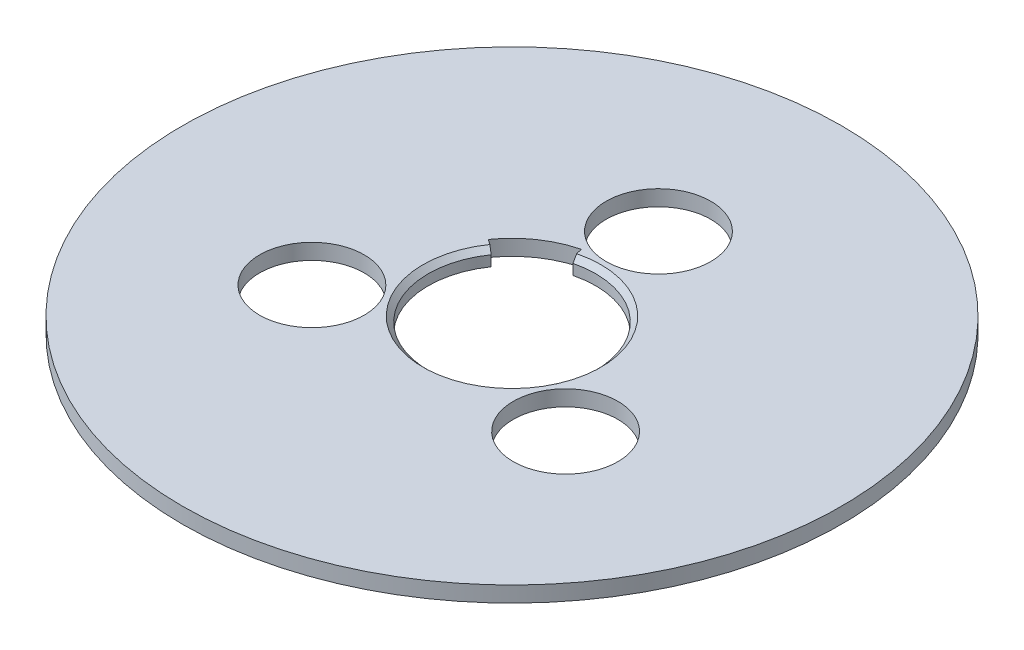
from build123d import *

# Parameters (mm, degrees)
SKETCH1_R           = 31.5
BOSS_EXTRUDE1_DEPTH = 1.5
CHAMFER1_SIZE       = 0.5
SKETCH2_R           = 5
CUT_EXTRUDE1_DEPTH  = 45.572973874


with BuildPart() as part:
    # Sketch1 → Boss-Extrude1 (new body)
    with BuildSketch(Plane(origin=(0, 0, 0), x_dir=(1, 0, 0), z_dir=(0, 1, 0))):
        with Locations(Location((0, 0, 0), (0, 0, 270))):
            Circle(SKETCH1_R)
        with BuildLine():
            Line((-1.938841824, 7.761500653), (-2.070683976, 8.289286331))
            Line((-2.070683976, 8.289286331), (-2.205432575, 8.828706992))
            ThreePointArc((-2.205432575, 8.828706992), (-5.164976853, 7.492196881), (-7.466804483, 5.201618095))
            Line((-7.466804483, 5.201618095), (-7.010594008, 4.883807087))
            Line((-7.010594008, 4.883807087), (-6.564223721, 4.572851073))
            ThreePointArc((-6.564223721, 4.572851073), (4.540638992, -6.586546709), (-1.938841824, 7.761500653))
        make_face(mode=Mode.SUBTRACT)
    extrude(amount=-BOSS_EXTRUDE1_DEPTH)

    # Chamfer1
    chamfer1_edges = [part.edges().sort_by_distance(p)[0] for p in [
        (4.540638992, 0, 6.586546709),
    ]]
    chamfer(chamfer1_edges, length=CHAMFER1_SIZE)

    # Sketch2 → Cut-Extrude1 (cut, through all)
    with BuildSketch(Plane(origin=(0, 0, 0), x_dir=(1, 0, 0), z_dir=(0, 1, 0))):
        with Locations(Location((0, 14, 0), (0, 0, 270))):
            Circle(SKETCH2_R)
        with Locations(Location((12.124355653, -7, 0), (0, 0, 270))):
            Circle(SKETCH2_R)
        with Locations(Location((-12.124355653, -7, 0), (0, 0, 270))):
            Circle(SKETCH2_R)
    extrude(amount=-CUT_EXTRUDE1_DEPTH, mode=Mode.SUBTRACT)


solid = part.part
